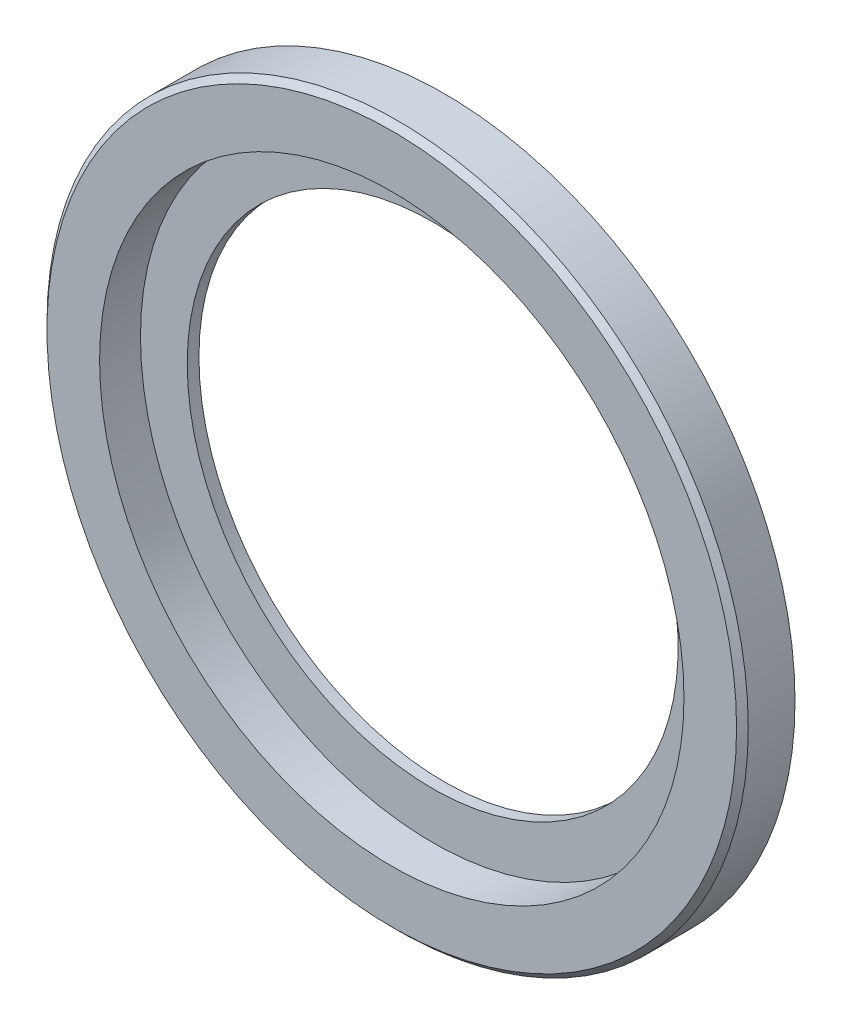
from build123d import *

# Parameters (mm, degrees)
SKETCH_1_R               = 60
EXTRUDE_2_DEPTH          = 9
SKETCH_3_R               = 50
CUT_EXTRUDE_3_DEPTH      = 7
SKETCH_4_R               = 42
CUT_EXTRUDE_4_DEPTH      = 2
CHAMFER_1_SIZE           = 1
PATTERN_CIRCULAR_1_COUNT = 8


with BuildPart() as part:
    # Sketch 1 → Extrude 2 (new body)
    with BuildSketch(Plane.XY):
        Circle(SKETCH_1_R)
    extrude(amount=EXTRUDE_2_DEPTH)

    # Sketch 3 → Cut-Extrude 3 (cut)
    with BuildSketch(Plane.XY.offset(9)):
        Circle(SKETCH_3_R)
    extrude(amount=-CUT_EXTRUDE_3_DEPTH, mode=Mode.SUBTRACT)

    # Sketch 4 → Cut-Extrude 4 (cut)
    with BuildSketch(Plane(origin=(0, 0, 0), x_dir=(-1, 0, 0), z_dir=(0, 0, -1))):
        Circle(SKETCH_4_R)
    extrude(amount=-CUT_EXTRUDE_4_DEPTH, mode=Mode.SUBTRACT)

    # Chamfer 1
    chamfer_1_edges = [part.edges().sort_by_distance(p)[0] for p in [
        (-60, 0, 9),
    ]]
    chamfer(chamfer_1_edges, length=CHAMFER_1_SIZE)

    # Sketch 6 → 5.0mm _1 (revolve, cut)
    with BuildSketch(Plane(origin=(0, 54, 0), x_dir=(0, 1, 0), z_dir=(1, 0, 0))):
        Polygon((0, 0), (0, 7.502151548), (2.5, 6), (2.5, 0.025), (2.525, 0), align=None)
    f_5_0mm_1 = revolve(axis=Axis((0, 54, -6.35), (0, 0, 1)), mode=Mode.SUBTRACT)

    # Pattern Circular 1: 5.0mm _1 ×8 about axis
    pattern_circular_1_axis = Axis((0, 0, 0), (0, 0, 1))
    for i in range(1, PATTERN_CIRCULAR_1_COUNT):
        add(f_5_0mm_1.rotate(pattern_circular_1_axis, i * 360 / PATTERN_CIRCULAR_1_COUNT), mode=Mode.SUBTRACT)


solid = part.part
